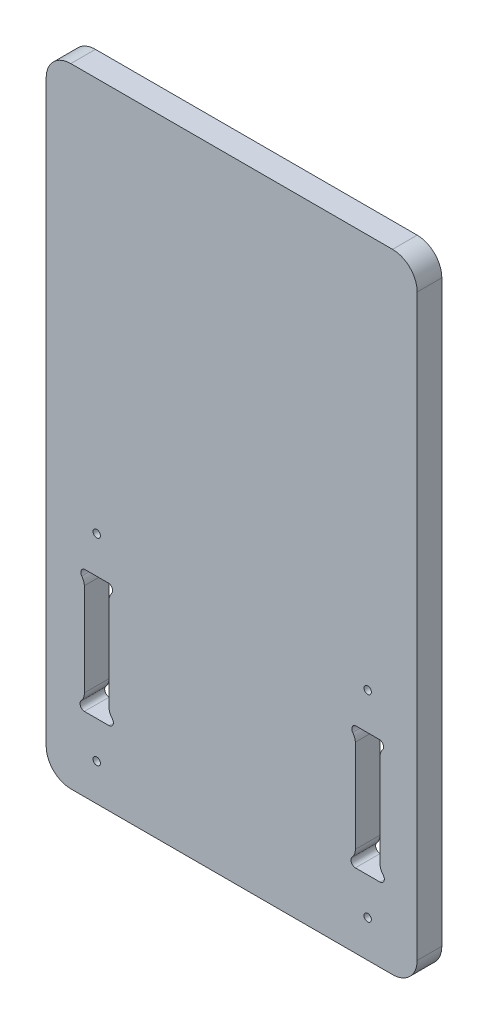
ISO-10303-21;
HEADER;
FILE_DESCRIPTION(('STEP AP214'),'2;1');
FILE_NAME('part.step','',(''),(''),'','','');
FILE_SCHEMA(('AUTOMOTIVE_DESIGN { 1 0 10303 214 1 1 1 1 }'));
ENDSEC;
DATA;
#1=APPLICATION_CONTEXT('core data for automotive mechanical design processes');
#2=APPLICATION_PROTOCOL_DEFINITION('international standard','automotive_design',2000,#1);
#3=PRODUCT_CONTEXT('',#1,'mechanical');
#4=PRODUCT('Part','Part','',(#3));
#5=PRODUCT_RELATED_PRODUCT_CATEGORY('part','',(#4));
#6=PRODUCT_DEFINITION_FORMATION('','',#4);
#7=PRODUCT_DEFINITION_CONTEXT('part definition',#1,'design');
#8=PRODUCT_DEFINITION('design','',#6,#7);
#9=PRODUCT_DEFINITION_SHAPE('','',#8);
#10=(LENGTH_UNIT() NAMED_UNIT(*) SI_UNIT(.MILLI.,.METRE.));
#11=(NAMED_UNIT(*) PLANE_ANGLE_UNIT() SI_UNIT($,.RADIAN.));
#12=(NAMED_UNIT(*) SI_UNIT($,.STERADIAN.) SOLID_ANGLE_UNIT());
#13=UNCERTAINTY_MEASURE_WITH_UNIT(LENGTH_MEASURE(1.E-05),#10,'distance_accuracy_value','');
#14=(GEOMETRIC_REPRESENTATION_CONTEXT(3) GLOBAL_UNCERTAINTY_ASSIGNED_CONTEXT((#13)) GLOBAL_UNIT_ASSIGNED_CONTEXT((#10,
#11,#12)) REPRESENTATION_CONTEXT('',''));
#15=CARTESIAN_POINT('',(0.,0.,0.));
#16=DIRECTION('',(0.,0.,1.));
#17=DIRECTION('',(1.,0.,0.));
#18=AXIS2_PLACEMENT_3D('',#15,#16,#17);
#19=CARTESIAN_POINT('',(-65.5100990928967,-45.,10.));
#20=DIRECTION('',(0.,0.,1.));
#21=DIRECTION('',(1.,0.,0.));
#22=AXIS2_PLACEMENT_3D('',#19,#20,#21);
#23=PLANE('',#22);
#24=CARTESIAN_POINT('',(55.,-40.,10.));
#25=DIRECTION('',(0.,0.,1.));
#26=DIRECTION('',(-1.,0.,0.));
#27=AXIS2_PLACEMENT_3D('',#24,#25,#26);
#28=CIRCLE('',#27,1.5);
#29=CARTESIAN_POINT('',(53.5,-40.,10.));
#30=VERTEX_POINT('',#29);
#31=EDGE_CURVE('E661',#30,#30,#28,.T.);
#32=ORIENTED_EDGE('',*,*,#31,.F.);
#33=EDGE_LOOP('',(#32));
#34=FACE_BOUND('',#33,.T.);
#35=CARTESIAN_POINT('',(50.1277697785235,-23.1165738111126,10.));
#36=DIRECTION('',(0.,0.,1.));
#37=DIRECTION('',(1.,0.,0.));
#38=AXIS2_PLACEMENT_3D('',#35,#36,#37);
#39=CIRCLE('',#38,1.88775510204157);
#40=CARTESIAN_POINT('',(48.6220765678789,-21.9779310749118,10.));
#41=VERTEX_POINT('',#40);
#42=CARTESIAN_POINT('',(50.0000000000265,-25.,10.));
#43=VERTEX_POINT('',#42);
#44=EDGE_CURVE('E263',#41,#43,#39,.T.);
#45=ORIENTED_EDGE('',*,*,#44,.F.);
#46=CARTESIAN_POINT('',(44.8979591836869,-18.4905581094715,10.));
#47=DIRECTION('',(0.,0.,-1.));
#48=DIRECTION('',(1.,0.,0.));
#49=AXIS2_PLACEMENT_3D('',#46,#47,#48);
#50=CIRCLE('',#49,5.10204081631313);
#51=CARTESIAN_POINT('',(50.,-18.4905581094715,10.));
#52=VERTEX_POINT('',#51);
#53=EDGE_CURVE('E255',#52,#41,#50,.T.);
#54=ORIENTED_EDGE('',*,*,#53,.F.);
#55=DIRECTION('',(0.,-1.,0.));
#56=VECTOR('',#55,1.);
#57=CARTESIAN_POINT('',(50.,-18.4905581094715,10.));
#58=LINE('',#57,#56);
#59=CARTESIAN_POINT('',(50.,19.1989379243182,10.));
#60=VERTEX_POINT('',#59);
#61=EDGE_CURVE('E298',#60,#52,#58,.T.);
#62=ORIENTED_EDGE('',*,*,#61,.F.);
#63=CARTESIAN_POINT('',(44.9063812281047,18.9059049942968,10.));
#64=DIRECTION('',(0.,0.,-1.));
#65=DIRECTION('',(1.,0.,0.));
#66=AXIS2_PLACEMENT_3D('',#63,#64,#65);
#67=CIRCLE('',#66,5.10204081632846);
#68=CARTESIAN_POINT('',(48.9512370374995,22.0155612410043,10.));
#69=VERTEX_POINT('',#68);
#70=EDGE_CURVE('E296',#69,#60,#67,.T.);
#71=ORIENTED_EDGE('',*,*,#70,.F.);
#72=CARTESIAN_POINT('',(50.4478336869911,23.166134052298,10.));
#73=DIRECTION('',(0.,0.,1.));
#74=DIRECTION('',(1.,0.,0.));
#75=AXIS2_PLACEMENT_3D('',#72,#73,#74);
#76=CIRCLE('',#75,1.88775510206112);
#77=CARTESIAN_POINT('',(49.9999999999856,25.,10.));
#78=VERTEX_POINT('',#77);
#79=EDGE_CURVE('E294',#78,#69,#76,.T.);
#80=ORIENTED_EDGE('',*,*,#79,.F.);
#81=DIRECTION('',(-1.,0.,0.));
#82=VECTOR('',#81,1.);
#83=CARTESIAN_POINT('',(60.0000000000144,25.,10.));
#84=LINE('',#83,#82);
#85=CARTESIAN_POINT('',(60.0000000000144,25.,10.));
#86=VERTEX_POINT('',#85);
#87=EDGE_CURVE('E292',#86,#78,#84,.T.);
#88=ORIENTED_EDGE('',*,*,#87,.F.);
#89=CARTESIAN_POINT('',(59.5521663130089,23.166134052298,10.));
#90=DIRECTION('',(0.,0.,1.));
#91=DIRECTION('',(-1.,0.,0.));
#92=AXIS2_PLACEMENT_3D('',#89,#90,#91);
#93=CIRCLE('',#92,1.88775510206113);
#94=CARTESIAN_POINT('',(61.0487629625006,22.0155612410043,10.));
#95=VERTEX_POINT('',#94);
#96=EDGE_CURVE('E290',#95,#86,#93,.T.);
#97=ORIENTED_EDGE('',*,*,#96,.F.);
#98=CARTESIAN_POINT('',(65.0936187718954,18.9059049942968,10.));
#99=DIRECTION('',(0.,0.,-1.));
#100=DIRECTION('',(-1.,0.,0.));
#101=AXIS2_PLACEMENT_3D('',#98,#99,#100);
#102=CIRCLE('',#101,5.10204081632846);
#103=CARTESIAN_POINT('',(60.,19.1989379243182,10.));
#104=VERTEX_POINT('',#103);
#105=EDGE_CURVE('E288',#104,#95,#102,.T.);
#106=ORIENTED_EDGE('',*,*,#105,.F.);
#107=DIRECTION('',(0.,1.,0.));
#108=VECTOR('',#107,1.);
#109=CARTESIAN_POINT('',(60.,-18.4905581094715,10.));
#110=LINE('',#109,#108);
#111=CARTESIAN_POINT('',(60.,-18.4905581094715,10.));
#112=VERTEX_POINT('',#111);
#113=EDGE_CURVE('E286',#112,#104,#110,.T.);
#114=ORIENTED_EDGE('',*,*,#113,.F.);
#115=CARTESIAN_POINT('',(65.1020408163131,-18.4905581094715,10.));
#116=DIRECTION('',(0.,0.,-1.));
#117=DIRECTION('',(-1.,0.,0.));
#118=AXIS2_PLACEMENT_3D('',#115,#116,#117);
#119=CIRCLE('',#118,5.10204081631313);
#120=CARTESIAN_POINT('',(61.3779234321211,-21.9779310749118,10.));
#121=VERTEX_POINT('',#120);
#122=EDGE_CURVE('E284',#121,#112,#119,.T.);
#123=ORIENTED_EDGE('',*,*,#122,.F.);
#124=CARTESIAN_POINT('',(59.8722302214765,-23.1165738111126,10.));
#125=DIRECTION('',(0.,0.,1.));
#126=DIRECTION('',(-1.,0.,0.));
#127=AXIS2_PLACEMENT_3D('',#124,#125,#126);
#128=CIRCLE('',#127,1.88775510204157);
#129=CARTESIAN_POINT('',(59.9999999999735,-25.,10.));
#130=VERTEX_POINT('',#129);
#131=EDGE_CURVE('E279',#130,#121,#128,.T.);
#132=ORIENTED_EDGE('',*,*,#131,.F.);
#133=DIRECTION('',(1.,0.,0.));
#134=VECTOR('',#133,1.);
#135=CARTESIAN_POINT('',(50.0000000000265,-25.,10.));
#136=LINE('',#135,#134);
#137=EDGE_CURVE('E277',#43,#130,#136,.T.);
#138=ORIENTED_EDGE('',*,*,#137,.F.);
#139=EDGE_LOOP('',(#45,#54,#62,#71,#80,#88,#97,#106,#114,#123,#132,#138));
#140=FACE_BOUND('',#139,.T.);
#141=DIRECTION('',(1.,0.,0.));
#142=VECTOR('',#141,1.);
#143=CARTESIAN_POINT('',(-50.0000000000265,-25.,10.));
#144=LINE('',#143,#142);
#145=CARTESIAN_POINT('',(-59.9999999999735,-25.,10.));
#146=VERTEX_POINT('',#145);
#147=CARTESIAN_POINT('',(-50.0000000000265,-25.,10.));
#148=VERTEX_POINT('',#147);
#149=EDGE_CURVE('E353',#146,#148,#144,.T.);
#150=ORIENTED_EDGE('',*,*,#149,.F.);
#151=CARTESIAN_POINT('',(-59.8722302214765,-23.1165738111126,10.));
#152=DIRECTION('',(0.,0.,1.));
#153=DIRECTION('',(1.,0.,0.));
#154=AXIS2_PLACEMENT_3D('',#151,#152,#153);
#155=CIRCLE('',#154,1.88775510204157);
#156=CARTESIAN_POINT('',(-61.3779234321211,-21.9779310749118,10.));
#157=VERTEX_POINT('',#156);
#158=EDGE_CURVE('E351',#157,#146,#155,.T.);
#159=ORIENTED_EDGE('',*,*,#158,.F.);
#160=CARTESIAN_POINT('',(-65.1020408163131,-18.4905581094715,10.));
#161=DIRECTION('',(0.,0.,-1.));
#162=DIRECTION('',(1.,0.,0.));
#163=AXIS2_PLACEMENT_3D('',#160,#161,#162);
#164=CIRCLE('',#163,5.10204081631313);
#165=CARTESIAN_POINT('',(-60.,-18.4905581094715,10.));
#166=VERTEX_POINT('',#165);
#167=EDGE_CURVE('E375',#166,#157,#164,.T.);
#168=ORIENTED_EDGE('',*,*,#167,.F.);
#169=DIRECTION('',(0.,-1.,0.));
#170=VECTOR('',#169,1.);
#171=CARTESIAN_POINT('',(-60.,-18.4905581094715,10.));
#172=LINE('',#171,#170);
#173=CARTESIAN_POINT('',(-60.,19.1989379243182,10.));
#174=VERTEX_POINT('',#173);
#175=EDGE_CURVE('E372',#174,#166,#172,.T.);
#176=ORIENTED_EDGE('',*,*,#175,.F.);
#177=CARTESIAN_POINT('',(-65.0936187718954,18.9059049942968,10.));
#178=DIRECTION('',(0.,0.,-1.));
#179=DIRECTION('',(1.,0.,0.));
#180=AXIS2_PLACEMENT_3D('',#177,#178,#179);
#181=CIRCLE('',#180,5.10204081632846);
#182=CARTESIAN_POINT('',(-61.0487629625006,22.0155612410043,10.));
#183=VERTEX_POINT('',#182);
#184=EDGE_CURVE('E370',#183,#174,#181,.T.);
#185=ORIENTED_EDGE('',*,*,#184,.F.);
#186=CARTESIAN_POINT('',(-59.5521663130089,23.166134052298,10.));
#187=DIRECTION('',(0.,0.,1.));
#188=DIRECTION('',(1.,0.,0.));
#189=AXIS2_PLACEMENT_3D('',#186,#187,#188);
#190=CIRCLE('',#189,1.88775510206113);
#191=CARTESIAN_POINT('',(-60.0000000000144,25.,10.));
#192=VERTEX_POINT('',#191);
#193=EDGE_CURVE('E368',#192,#183,#190,.T.);
#194=ORIENTED_EDGE('',*,*,#193,.F.);
#195=DIRECTION('',(-1.,0.,0.));
#196=VECTOR('',#195,1.);
#197=CARTESIAN_POINT('',(-60.0000000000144,25.,10.));
#198=LINE('',#197,#196);
#199=CARTESIAN_POINT('',(-49.9999999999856,25.,10.));
#200=VERTEX_POINT('',#199);
#201=EDGE_CURVE('E366',#200,#192,#198,.T.);
#202=ORIENTED_EDGE('',*,*,#201,.F.);
#203=CARTESIAN_POINT('',(-50.4478336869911,23.166134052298,10.));
#204=DIRECTION('',(0.,0.,1.));
#205=DIRECTION('',(-1.,0.,0.));
#206=AXIS2_PLACEMENT_3D('',#203,#204,#205);
#207=CIRCLE('',#206,1.88775510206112);
#208=CARTESIAN_POINT('',(-48.9512370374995,22.0155612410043,10.));
#209=VERTEX_POINT('',#208);
#210=EDGE_CURVE('E364',#209,#200,#207,.T.);
#211=ORIENTED_EDGE('',*,*,#210,.F.);
#212=CARTESIAN_POINT('',(-44.9063812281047,18.9059049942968,10.));
#213=DIRECTION('',(0.,0.,-1.));
#214=DIRECTION('',(-1.,0.,0.));
#215=AXIS2_PLACEMENT_3D('',#212,#213,#214);
#216=CIRCLE('',#215,5.10204081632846);
#217=CARTESIAN_POINT('',(-50.,19.1989379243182,10.));
#218=VERTEX_POINT('',#217);
#219=EDGE_CURVE('E362',#218,#209,#216,.T.);
#220=ORIENTED_EDGE('',*,*,#219,.F.);
#221=DIRECTION('',(0.,1.,0.));
#222=VECTOR('',#221,1.);
#223=CARTESIAN_POINT('',(-50.,-18.4905581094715,10.));
#224=LINE('',#223,#222);
#225=CARTESIAN_POINT('',(-50.,-18.4905581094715,10.));
#226=VERTEX_POINT('',#225);
#227=EDGE_CURVE('E360',#226,#218,#224,.T.);
#228=ORIENTED_EDGE('',*,*,#227,.F.);
#229=CARTESIAN_POINT('',(-44.8979591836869,-18.4905581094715,10.));
#230=DIRECTION('',(0.,0.,-1.));
#231=DIRECTION('',(-1.,0.,0.));
#232=AXIS2_PLACEMENT_3D('',#229,#230,#231);
#233=CIRCLE('',#232,5.10204081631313);
#234=CARTESIAN_POINT('',(-48.6220765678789,-21.9779310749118,10.));
#235=VERTEX_POINT('',#234);
#236=EDGE_CURVE('E358',#235,#226,#233,.T.);
#237=ORIENTED_EDGE('',*,*,#236,.F.);
#238=CARTESIAN_POINT('',(-50.1277697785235,-23.1165738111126,10.));
#239=DIRECTION('',(0.,0.,1.));
#240=DIRECTION('',(-1.,0.,0.));
#241=AXIS2_PLACEMENT_3D('',#238,#239,#240);
#242=CIRCLE('',#241,1.88775510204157);
#243=EDGE_CURVE('E356',#148,#235,#242,.T.);
#244=ORIENTED_EDGE('',*,*,#243,.F.);
#245=EDGE_LOOP('',(#150,#159,#168,#176,#185,#194,#202,#211,#220,#228,#237,#244));
#246=FACE_BOUND('',#245,.T.);
#247=CARTESIAN_POINT('',(-55.,40.,10.));
#248=DIRECTION('',(0.,0.,1.));
#249=DIRECTION('',(-1.,0.,0.));
#250=AXIS2_PLACEMENT_3D('',#247,#248,#249);
#251=CIRCLE('',#250,1.5);
#252=CARTESIAN_POINT('',(-56.5,40.,10.));
#253=VERTEX_POINT('',#252);
#254=EDGE_CURVE('E437',#253,#253,#251,.T.);
#255=ORIENTED_EDGE('',*,*,#254,.F.);
#256=EDGE_LOOP('',(#255));
#257=FACE_BOUND('',#256,.T.);
#258=CARTESIAN_POINT('',(-65.5100990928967,-45.,10.));
#259=DIRECTION('',(0.,0.,1.));
#260=DIRECTION('',(1.,0.,0.));
#261=AXIS2_PLACEMENT_3D('',#258,#259,#260);
#262=CIRCLE('',#261,10.);
#263=CARTESIAN_POINT('',(-75.5100990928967,-45.,10.));
#264=VERTEX_POINT('',#263);
#265=CARTESIAN_POINT('',(-65.5100990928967,-55.,10.));
#266=VERTEX_POINT('',#265);
#267=EDGE_CURVE('E441',#264,#266,#262,.T.);
#268=ORIENTED_EDGE('',*,*,#267,.T.);
#269=DIRECTION('',(1.,0.,0.));
#270=VECTOR('',#269,1.);
#271=CARTESIAN_POINT('',(-65.5100990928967,-55.,10.));
#272=LINE('',#271,#270);
#273=CARTESIAN_POINT('',(65.1021458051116,-55.,10.));
#274=VERTEX_POINT('',#273);
#275=EDGE_CURVE('E444',#266,#274,#272,.T.);
#276=ORIENTED_EDGE('',*,*,#275,.T.);
#277=CARTESIAN_POINT('',(65.1021458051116,-45.,10.));
#278=DIRECTION('',(0.,0.,1.));
#279=DIRECTION('',(1.,0.,0.));
#280=AXIS2_PLACEMENT_3D('',#277,#278,#279);
#281=CIRCLE('',#280,10.);
#282=CARTESIAN_POINT('',(75.1021458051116,-45.,10.));
#283=VERTEX_POINT('',#282);
#284=EDGE_CURVE('E447',#274,#283,#281,.T.);
#285=ORIENTED_EDGE('',*,*,#284,.T.);
#286=DIRECTION('',(0.,1.,0.));
#287=VECTOR('',#286,1.);
#288=CARTESIAN_POINT('',(75.1021458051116,-45.0000000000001,10.));
#289=LINE('',#288,#287);
#290=CARTESIAN_POINT('',(75.1021458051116,190.,10.));
#291=VERTEX_POINT('',#290);
#292=EDGE_CURVE('E449',#283,#291,#289,.T.);
#293=ORIENTED_EDGE('',*,*,#292,.T.);
#294=CARTESIAN_POINT('',(65.1021458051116,190.,10.));
#295=DIRECTION('',(0.,0.,1.));
#296=DIRECTION('',(1.,0.,0.));
#297=AXIS2_PLACEMENT_3D('',#294,#295,#296);
#298=CIRCLE('',#297,10.);
#299=CARTESIAN_POINT('',(65.1021458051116,200.,10.));
#300=VERTEX_POINT('',#299);
#301=EDGE_CURVE('E451',#291,#300,#298,.T.);
#302=ORIENTED_EDGE('',*,*,#301,.T.);
#303=DIRECTION('',(-1.,0.,0.));
#304=VECTOR('',#303,1.);
#305=CARTESIAN_POINT('',(-65.5100990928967,200.,10.));
#306=LINE('',#305,#304);
#307=CARTESIAN_POINT('',(-65.5100990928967,200.,10.));
#308=VERTEX_POINT('',#307);
#309=EDGE_CURVE('E453',#300,#308,#306,.T.);
#310=ORIENTED_EDGE('',*,*,#309,.T.);
#311=CARTESIAN_POINT('',(-65.5100990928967,190.,10.));
#312=DIRECTION('',(0.,0.,1.));
#313=DIRECTION('',(-1.,0.,0.));
#314=AXIS2_PLACEMENT_3D('',#311,#312,#313);
#315=CIRCLE('',#314,10.);
#316=CARTESIAN_POINT('',(-75.5100990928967,190.,10.));
#317=VERTEX_POINT('',#316);
#318=EDGE_CURVE('E455',#308,#317,#315,.T.);
#319=ORIENTED_EDGE('',*,*,#318,.T.);
#320=DIRECTION('',(0.,-1.,0.));
#321=VECTOR('',#320,1.);
#322=CARTESIAN_POINT('',(-75.5100990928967,190.,10.));
#323=LINE('',#322,#321);
#324=EDGE_CURVE('E457',#317,#264,#323,.T.);
#325=ORIENTED_EDGE('',*,*,#324,.T.);
#326=EDGE_LOOP('',(#268,#276,#285,#293,#302,#310,#319,#325));
#327=FACE_BOUND('',#326,.T.);
#328=CARTESIAN_POINT('',(-55.,-40.,10.));
#329=DIRECTION('',(0.,0.,1.));
#330=DIRECTION('',(1.,0.,0.));
#331=AXIS2_PLACEMENT_3D('',#328,#329,#330);
#332=CIRCLE('',#331,1.5);
#333=CARTESIAN_POINT('',(-53.5,-40.,10.));
#334=VERTEX_POINT('',#333);
#335=EDGE_CURVE('E301',#334,#334,#332,.T.);
#336=ORIENTED_EDGE('',*,*,#335,.F.);
#337=EDGE_LOOP('',(#336));
#338=FACE_BOUND('',#337,.T.);
#339=CARTESIAN_POINT('',(55.,40.,10.));
#340=DIRECTION('',(0.,0.,1.));
#341=DIRECTION('',(1.,0.,0.));
#342=AXIS2_PLACEMENT_3D('',#339,#340,#341);
#343=CIRCLE('',#342,1.5);
#344=CARTESIAN_POINT('',(56.5,40.,10.));
#345=VERTEX_POINT('',#344);
#346=EDGE_CURVE('E662',#345,#345,#343,.T.);
#347=ORIENTED_EDGE('',*,*,#346,.F.);
#348=EDGE_LOOP('',(#347));
#349=FACE_BOUND('',#348,.T.);
#350=ADVANCED_FACE('F45',(#34,#140,#246,#257,#327,#338,#349),#23,.T.);
#351=CARTESIAN_POINT('',(-65.5100990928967,-45.,0.));
#352=DIRECTION('',(0.,0.,1.));
#353=DIRECTION('',(1.,0.,0.));
#354=AXIS2_PLACEMENT_3D('',#351,#352,#353);
#355=PLANE('',#354);
#356=CARTESIAN_POINT('',(-55.,-40.,0.));
#357=DIRECTION('',(0.,0.,1.));
#358=DIRECTION('',(1.,0.,0.));
#359=AXIS2_PLACEMENT_3D('',#356,#357,#358);
#360=CIRCLE('',#359,3.70000000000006);
#361=CARTESIAN_POINT('',(-51.2999999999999,-40.,0.));
#362=VERTEX_POINT('',#361);
#363=EDGE_CURVE('E507',#362,#362,#360,.T.);
#364=ORIENTED_EDGE('',*,*,#363,.T.);
#365=EDGE_LOOP('',(#364));
#366=FACE_BOUND('',#365,.T.);
#367=CARTESIAN_POINT('',(55.,-40.,0.));
#368=DIRECTION('',(0.,0.,1.));
#369=DIRECTION('',(1.,0.,0.));
#370=AXIS2_PLACEMENT_3D('',#367,#368,#369);
#371=CIRCLE('',#370,3.70000000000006);
#372=CARTESIAN_POINT('',(58.7000000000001,-40.,0.));
#373=VERTEX_POINT('',#372);
#374=EDGE_CURVE('E504',#373,#373,#371,.T.);
#375=ORIENTED_EDGE('',*,*,#374,.T.);
#376=EDGE_LOOP('',(#375));
#377=FACE_BOUND('',#376,.T.);
#378=CARTESIAN_POINT('',(-55.,40.,0.));
#379=DIRECTION('',(0.,0.,1.));
#380=DIRECTION('',(1.,0.,0.));
#381=AXIS2_PLACEMENT_3D('',#378,#379,#380);
#382=CIRCLE('',#381,3.69999999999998);
#383=CARTESIAN_POINT('',(-51.3,40.,0.));
#384=VERTEX_POINT('',#383);
#385=EDGE_CURVE('E501',#384,#384,#382,.T.);
#386=ORIENTED_EDGE('',*,*,#385,.T.);
#387=EDGE_LOOP('',(#386));
#388=FACE_BOUND('',#387,.T.);
#389=CARTESIAN_POINT('',(55.,40.,0.));
#390=DIRECTION('',(0.,0.,1.));
#391=DIRECTION('',(1.,0.,0.));
#392=AXIS2_PLACEMENT_3D('',#389,#390,#391);
#393=CIRCLE('',#392,3.69999999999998);
#394=CARTESIAN_POINT('',(58.7,40.,0.));
#395=VERTEX_POINT('',#394);
#396=EDGE_CURVE('E498',#395,#395,#393,.T.);
#397=ORIENTED_EDGE('',*,*,#396,.T.);
#398=EDGE_LOOP('',(#397));
#399=FACE_BOUND('',#398,.T.);
#400=CARTESIAN_POINT('',(-59.8722302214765,-23.1165738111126,0.));
#401=DIRECTION('',(0.,0.,1.));
#402=DIRECTION('',(1.,0.,0.));
#403=AXIS2_PLACEMENT_3D('',#400,#401,#402);
#404=CIRCLE('',#403,1.88775510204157);
#405=CARTESIAN_POINT('',(-61.3779234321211,-21.9779310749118,0.));
#406=VERTEX_POINT('',#405);
#407=CARTESIAN_POINT('',(-59.9999999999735,-25.,0.));
#408=VERTEX_POINT('',#407);
#409=EDGE_CURVE('E271',#406,#408,#404,.T.);
#410=ORIENTED_EDGE('',*,*,#409,.T.);
#411=DIRECTION('',(1.,0.,0.));
#412=VECTOR('',#411,1.);
#413=CARTESIAN_POINT('',(-50.0000000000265,-25.,0.));
#414=LINE('',#413,#412);
#415=CARTESIAN_POINT('',(-50.0000000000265,-25.,0.));
#416=VERTEX_POINT('',#415);
#417=EDGE_CURVE('E380',#408,#416,#414,.T.);
#418=ORIENTED_EDGE('',*,*,#417,.T.);
#419=CARTESIAN_POINT('',(-50.1277697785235,-23.1165738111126,0.));
#420=DIRECTION('',(0.,0.,1.));
#421=DIRECTION('',(-1.,0.,0.));
#422=AXIS2_PLACEMENT_3D('',#419,#420,#421);
#423=CIRCLE('',#422,1.88775510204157);
#424=CARTESIAN_POINT('',(-48.6220765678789,-21.9779310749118,0.));
#425=VERTEX_POINT('',#424);
#426=EDGE_CURVE('E383',#416,#425,#423,.T.);
#427=ORIENTED_EDGE('',*,*,#426,.T.);
#428=CARTESIAN_POINT('',(-44.8979591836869,-18.4905581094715,0.));
#429=DIRECTION('',(0.,0.,-1.));
#430=DIRECTION('',(-1.,0.,0.));
#431=AXIS2_PLACEMENT_3D('',#428,#429,#430);
#432=CIRCLE('',#431,5.10204081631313);
#433=CARTESIAN_POINT('',(-50.,-18.4905581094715,0.));
#434=VERTEX_POINT('',#433);
#435=EDGE_CURVE('E386',#425,#434,#432,.T.);
#436=ORIENTED_EDGE('',*,*,#435,.T.);
#437=DIRECTION('',(0.,1.,0.));
#438=VECTOR('',#437,1.);
#439=CARTESIAN_POINT('',(-50.,-18.4905581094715,0.));
#440=LINE('',#439,#438);
#441=CARTESIAN_POINT('',(-50.,19.1989379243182,0.));
#442=VERTEX_POINT('',#441);
#443=EDGE_CURVE('E389',#434,#442,#440,.T.);
#444=ORIENTED_EDGE('',*,*,#443,.T.);
#445=CARTESIAN_POINT('',(-44.9063812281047,18.9059049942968,0.));
#446=DIRECTION('',(0.,0.,-1.));
#447=DIRECTION('',(-1.,0.,0.));
#448=AXIS2_PLACEMENT_3D('',#445,#446,#447);
#449=CIRCLE('',#448,5.10204081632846);
#450=CARTESIAN_POINT('',(-48.9512370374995,22.0155612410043,0.));
#451=VERTEX_POINT('',#450);
#452=EDGE_CURVE('E392',#442,#451,#449,.T.);
#453=ORIENTED_EDGE('',*,*,#452,.T.);
#454=CARTESIAN_POINT('',(-50.4478336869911,23.166134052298,0.));
#455=DIRECTION('',(0.,0.,1.));
#456=DIRECTION('',(-1.,0.,0.));
#457=AXIS2_PLACEMENT_3D('',#454,#455,#456);
#458=CIRCLE('',#457,1.88775510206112);
#459=CARTESIAN_POINT('',(-49.9999999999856,25.,0.));
#460=VERTEX_POINT('',#459);
#461=EDGE_CURVE('E395',#451,#460,#458,.T.);
#462=ORIENTED_EDGE('',*,*,#461,.T.);
#463=DIRECTION('',(-1.,0.,0.));
#464=VECTOR('',#463,1.);
#465=CARTESIAN_POINT('',(-60.0000000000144,25.,0.));
#466=LINE('',#465,#464);
#467=CARTESIAN_POINT('',(-60.0000000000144,25.,0.));
#468=VERTEX_POINT('',#467);
#469=EDGE_CURVE('E398',#460,#468,#466,.T.);
#470=ORIENTED_EDGE('',*,*,#469,.T.);
#471=CARTESIAN_POINT('',(-59.5521663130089,23.166134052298,0.));
#472=DIRECTION('',(0.,0.,1.));
#473=DIRECTION('',(1.,0.,0.));
#474=AXIS2_PLACEMENT_3D('',#471,#472,#473);
#475=CIRCLE('',#474,1.88775510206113);
#476=CARTESIAN_POINT('',(-61.0487629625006,22.0155612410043,0.));
#477=VERTEX_POINT('',#476);
#478=EDGE_CURVE('E401',#468,#477,#475,.T.);
#479=ORIENTED_EDGE('',*,*,#478,.T.);
#480=CARTESIAN_POINT('',(-65.0936187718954,18.9059049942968,0.));
#481=DIRECTION('',(0.,0.,-1.));
#482=DIRECTION('',(1.,0.,0.));
#483=AXIS2_PLACEMENT_3D('',#480,#481,#482);
#484=CIRCLE('',#483,5.10204081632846);
#485=CARTESIAN_POINT('',(-60.,19.1989379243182,0.));
#486=VERTEX_POINT('',#485);
#487=EDGE_CURVE('E404',#477,#486,#484,.T.);
#488=ORIENTED_EDGE('',*,*,#487,.T.);
#489=DIRECTION('',(0.,-1.,0.));
#490=VECTOR('',#489,1.);
#491=CARTESIAN_POINT('',(-60.,-18.4905581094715,0.));
#492=LINE('',#491,#490);
#493=CARTESIAN_POINT('',(-60.,-18.4905581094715,0.));
#494=VERTEX_POINT('',#493);
#495=EDGE_CURVE('E407',#486,#494,#492,.T.);
#496=ORIENTED_EDGE('',*,*,#495,.T.);
#497=CARTESIAN_POINT('',(-65.1020408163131,-18.4905581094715,0.));
#498=DIRECTION('',(0.,0.,-1.));
#499=DIRECTION('',(1.,0.,0.));
#500=AXIS2_PLACEMENT_3D('',#497,#498,#499);
#501=CIRCLE('',#500,5.10204081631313);
#502=EDGE_CURVE('E354',#494,#406,#501,.T.);
#503=ORIENTED_EDGE('',*,*,#502,.T.);
#504=EDGE_LOOP('',(#410,#418,#427,#436,#444,#453,#462,#470,#479,#488,#496,#503));
#505=FACE_BOUND('',#504,.T.);
#506=CARTESIAN_POINT('',(-65.5100990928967,-45.,0.));
#507=DIRECTION('',(0.,0.,1.));
#508=DIRECTION('',(1.,0.,0.));
#509=AXIS2_PLACEMENT_3D('',#506,#507,#508);
#510=CIRCLE('',#509,10.);
#511=CARTESIAN_POINT('',(-75.5100990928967,-45.,0.));
#512=VERTEX_POINT('',#511);
#513=CARTESIAN_POINT('',(-65.5100990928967,-55.,0.));
#514=VERTEX_POINT('',#513);
#515=EDGE_CURVE('E440',#512,#514,#510,.T.);
#516=ORIENTED_EDGE('',*,*,#515,.F.);
#517=DIRECTION('',(0.,-1.,0.));
#518=VECTOR('',#517,1.);
#519=CARTESIAN_POINT('',(-75.5100990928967,190.,0.));
#520=LINE('',#519,#518);
#521=CARTESIAN_POINT('',(-75.5100990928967,190.,0.));
#522=VERTEX_POINT('',#521);
#523=EDGE_CURVE('E445',#522,#512,#520,.T.);
#524=ORIENTED_EDGE('',*,*,#523,.F.);
#525=CARTESIAN_POINT('',(-65.5100990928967,190.,0.));
#526=DIRECTION('',(0.,0.,1.));
#527=DIRECTION('',(-1.,0.,0.));
#528=AXIS2_PLACEMENT_3D('',#525,#526,#527);
#529=CIRCLE('',#528,10.);
#530=CARTESIAN_POINT('',(-65.5100990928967,200.,0.));
#531=VERTEX_POINT('',#530);
#532=EDGE_CURVE('E472',#531,#522,#529,.T.);
#533=ORIENTED_EDGE('',*,*,#532,.F.);
#534=DIRECTION('',(-1.,0.,0.));
#535=VECTOR('',#534,1.);
#536=CARTESIAN_POINT('',(-65.5100990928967,200.,0.));
#537=LINE('',#536,#535);
#538=CARTESIAN_POINT('',(65.1021458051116,200.,0.));
#539=VERTEX_POINT('',#538);
#540=EDGE_CURVE('E470',#539,#531,#537,.T.);
#541=ORIENTED_EDGE('',*,*,#540,.F.);
#542=CARTESIAN_POINT('',(65.1021458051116,190.,0.));
#543=DIRECTION('',(0.,0.,1.));
#544=DIRECTION('',(1.,0.,0.));
#545=AXIS2_PLACEMENT_3D('',#542,#543,#544);
#546=CIRCLE('',#545,10.);
#547=CARTESIAN_POINT('',(75.1021458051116,190.,0.));
#548=VERTEX_POINT('',#547);
#549=EDGE_CURVE('E468',#548,#539,#546,.T.);
#550=ORIENTED_EDGE('',*,*,#549,.F.);
#551=DIRECTION('',(0.,1.,0.));
#552=VECTOR('',#551,1.);
#553=CARTESIAN_POINT('',(75.1021458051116,-45.0000000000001,0.));
#554=LINE('',#553,#552);
#555=CARTESIAN_POINT('',(75.1021458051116,-45.,0.));
#556=VERTEX_POINT('',#555);
#557=EDGE_CURVE('E466',#556,#548,#554,.T.);
#558=ORIENTED_EDGE('',*,*,#557,.F.);
#559=CARTESIAN_POINT('',(65.1021458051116,-45.,0.));
#560=DIRECTION('',(0.,0.,1.));
#561=DIRECTION('',(1.,0.,0.));
#562=AXIS2_PLACEMENT_3D('',#559,#560,#561);
#563=CIRCLE('',#562,10.);
#564=CARTESIAN_POINT('',(65.1021458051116,-55.,0.));
#565=VERTEX_POINT('',#564);
#566=EDGE_CURVE('E464',#565,#556,#563,.T.);
#567=ORIENTED_EDGE('',*,*,#566,.F.);
#568=DIRECTION('',(1.,0.,0.));
#569=VECTOR('',#568,1.);
#570=CARTESIAN_POINT('',(-65.5100990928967,-55.,0.));
#571=LINE('',#570,#569);
#572=EDGE_CURVE('E462',#514,#565,#571,.T.);
#573=ORIENTED_EDGE('',*,*,#572,.F.);
#574=EDGE_LOOP('',(#516,#524,#533,#541,#550,#558,#567,#573));
#575=FACE_BOUND('',#574,.T.);
#576=CARTESIAN_POINT('',(44.8979591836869,-18.4905581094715,0.));
#577=DIRECTION('',(0.,0.,-1.));
#578=DIRECTION('',(1.,0.,0.));
#579=AXIS2_PLACEMENT_3D('',#576,#577,#578);
#580=CIRCLE('',#579,5.10204081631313);
#581=CARTESIAN_POINT('',(50.,-18.4905581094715,0.));
#582=VERTEX_POINT('',#581);
#583=CARTESIAN_POINT('',(48.6220765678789,-21.9779310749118,0.));
#584=VERTEX_POINT('',#583);
#585=EDGE_CURVE('E69',#582,#584,#580,.T.);
#586=ORIENTED_EDGE('',*,*,#585,.T.);
#587=CARTESIAN_POINT('',(50.1277697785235,-23.1165738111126,0.));
#588=DIRECTION('',(0.,0.,1.));
#589=DIRECTION('',(1.,0.,0.));
#590=AXIS2_PLACEMENT_3D('',#587,#588,#589);
#591=CIRCLE('',#590,1.88775510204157);
#592=CARTESIAN_POINT('',(50.0000000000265,-25.,0.));
#593=VERTEX_POINT('',#592);
#594=EDGE_CURVE('E270',#584,#593,#591,.T.);
#595=ORIENTED_EDGE('',*,*,#594,.T.);
#596=DIRECTION('',(1.,0.,0.));
#597=VECTOR('',#596,1.);
#598=CARTESIAN_POINT('',(50.0000000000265,-25.,0.));
#599=LINE('',#598,#597);
#600=CARTESIAN_POINT('',(59.9999999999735,-25.,0.));
#601=VERTEX_POINT('',#600);
#602=EDGE_CURVE('E303',#593,#601,#599,.T.);
#603=ORIENTED_EDGE('',*,*,#602,.T.);
#604=CARTESIAN_POINT('',(59.8722302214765,-23.1165738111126,0.));
#605=DIRECTION('',(0.,0.,1.));
#606=DIRECTION('',(-1.,0.,0.));
#607=AXIS2_PLACEMENT_3D('',#604,#605,#606);
#608=CIRCLE('',#607,1.88775510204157);
#609=CARTESIAN_POINT('',(61.3779234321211,-21.9779310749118,0.));
#610=VERTEX_POINT('',#609);
#611=EDGE_CURVE('E306',#601,#610,#608,.T.);
#612=ORIENTED_EDGE('',*,*,#611,.T.);
#613=CARTESIAN_POINT('',(65.1020408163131,-18.4905581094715,0.));
#614=DIRECTION('',(0.,0.,-1.));
#615=DIRECTION('',(-1.,0.,0.));
#616=AXIS2_PLACEMENT_3D('',#613,#614,#615);
#617=CIRCLE('',#616,5.10204081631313);
#618=CARTESIAN_POINT('',(60.,-18.4905581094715,0.));
#619=VERTEX_POINT('',#618);
#620=EDGE_CURVE('E309',#610,#619,#617,.T.);
#621=ORIENTED_EDGE('',*,*,#620,.T.);
#622=DIRECTION('',(0.,1.,0.));
#623=VECTOR('',#622,1.);
#624=CARTESIAN_POINT('',(60.,-18.4905581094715,0.));
#625=LINE('',#624,#623);
#626=CARTESIAN_POINT('',(60.,19.1989379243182,0.));
#627=VERTEX_POINT('',#626);
#628=EDGE_CURVE('E312',#619,#627,#625,.T.);
#629=ORIENTED_EDGE('',*,*,#628,.T.);
#630=CARTESIAN_POINT('',(65.0936187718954,18.9059049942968,0.));
#631=DIRECTION('',(0.,0.,-1.));
#632=DIRECTION('',(-1.,0.,0.));
#633=AXIS2_PLACEMENT_3D('',#630,#631,#632);
#634=CIRCLE('',#633,5.10204081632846);
#635=CARTESIAN_POINT('',(61.0487629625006,22.0155612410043,0.));
#636=VERTEX_POINT('',#635);
#637=EDGE_CURVE('E315',#627,#636,#634,.T.);
#638=ORIENTED_EDGE('',*,*,#637,.T.);
#639=CARTESIAN_POINT('',(59.5521663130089,23.166134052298,0.));
#640=DIRECTION('',(0.,0.,1.));
#641=DIRECTION('',(-1.,0.,0.));
#642=AXIS2_PLACEMENT_3D('',#639,#640,#641);
#643=CIRCLE('',#642,1.88775510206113);
#644=CARTESIAN_POINT('',(60.0000000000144,25.,0.));
#645=VERTEX_POINT('',#644);
#646=EDGE_CURVE('E318',#636,#645,#643,.T.);
#647=ORIENTED_EDGE('',*,*,#646,.T.);
#648=DIRECTION('',(-1.,0.,0.));
#649=VECTOR('',#648,1.);
#650=CARTESIAN_POINT('',(60.0000000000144,25.,0.));
#651=LINE('',#650,#649);
#652=CARTESIAN_POINT('',(49.9999999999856,25.,0.));
#653=VERTEX_POINT('',#652);
#654=EDGE_CURVE('E321',#645,#653,#651,.T.);
#655=ORIENTED_EDGE('',*,*,#654,.T.);
#656=CARTESIAN_POINT('',(50.4478336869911,23.166134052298,0.));
#657=DIRECTION('',(0.,0.,1.));
#658=DIRECTION('',(1.,0.,0.));
#659=AXIS2_PLACEMENT_3D('',#656,#657,#658);
#660=CIRCLE('',#659,1.88775510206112);
#661=CARTESIAN_POINT('',(48.9512370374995,22.0155612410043,0.));
#662=VERTEX_POINT('',#661);
#663=EDGE_CURVE('E324',#653,#662,#660,.T.);
#664=ORIENTED_EDGE('',*,*,#663,.T.);
#665=CARTESIAN_POINT('',(44.9063812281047,18.9059049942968,0.));
#666=DIRECTION('',(0.,0.,-1.));
#667=DIRECTION('',(1.,0.,0.));
#668=AXIS2_PLACEMENT_3D('',#665,#666,#667);
#669=CIRCLE('',#668,5.10204081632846);
#670=CARTESIAN_POINT('',(50.,19.1989379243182,0.));
#671=VERTEX_POINT('',#670);
#672=EDGE_CURVE('E327',#662,#671,#669,.T.);
#673=ORIENTED_EDGE('',*,*,#672,.T.);
#674=DIRECTION('',(0.,-1.,0.));
#675=VECTOR('',#674,1.);
#676=CARTESIAN_POINT('',(50.,-18.4905581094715,0.));
#677=LINE('',#676,#675);
#678=EDGE_CURVE('E264',#671,#582,#677,.T.);
#679=ORIENTED_EDGE('',*,*,#678,.T.);
#680=EDGE_LOOP('',(#586,#595,#603,#612,#621,#629,#638,#647,#655,#664,#673,#679));
#681=FACE_BOUND('',#680,.T.);
#682=ADVANCED_FACE('F527',(#366,#377,#388,#399,#505,#575,#681),#355,.F.);
#683=CARTESIAN_POINT('',(-65.5100990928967,-45.,10.));
#684=DIRECTION('',(0.,0.,-1.));
#685=DIRECTION('',(-1.,0.,0.));
#686=AXIS2_PLACEMENT_3D('',#683,#684,#685);
#687=CYLINDRICAL_SURFACE('',#686,10.);
#688=ORIENTED_EDGE('',*,*,#515,.T.);
#689=DIRECTION('',(0.,0.,-1.));
#690=VECTOR('',#689,1.);
#691=CARTESIAN_POINT('',(-65.5100990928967,-55.,10.));
#692=LINE('',#691,#690);
#693=EDGE_CURVE('E495',#266,#514,#692,.T.);
#694=ORIENTED_EDGE('',*,*,#693,.F.);
#695=ORIENTED_EDGE('',*,*,#267,.F.);
#696=DIRECTION('',(0.,0.,-1.));
#697=VECTOR('',#696,1.);
#698=CARTESIAN_POINT('',(-75.5100990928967,-45.,10.));
#699=LINE('',#698,#697);
#700=EDGE_CURVE('E459',#264,#512,#699,.T.);
#701=ORIENTED_EDGE('',*,*,#700,.T.);
#702=EDGE_LOOP('',(#688,#694,#695,#701));
#703=FACE_BOUND('',#702,.T.);
#704=ADVANCED_FACE('F530',(#703),#687,.T.);
#705=CARTESIAN_POINT('',(-65.5100990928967,-55.,10.));
#706=DIRECTION('',(0.,1.,0.));
#707=DIRECTION('',(0.,0.,1.));
#708=AXIS2_PLACEMENT_3D('',#705,#706,#707);
#709=PLANE('',#708);
#710=ORIENTED_EDGE('',*,*,#572,.T.);
#711=DIRECTION('',(0.,0.,-1.));
#712=VECTOR('',#711,1.);
#713=CARTESIAN_POINT('',(65.1021458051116,-55.,10.));
#714=LINE('',#713,#712);
#715=EDGE_CURVE('E492',#274,#565,#714,.T.);
#716=ORIENTED_EDGE('',*,*,#715,.F.);
#717=ORIENTED_EDGE('',*,*,#275,.F.);
#718=ORIENTED_EDGE('',*,*,#693,.T.);
#719=EDGE_LOOP('',(#710,#716,#717,#718));
#720=FACE_BOUND('',#719,.T.);
#721=ADVANCED_FACE('F623',(#720),#709,.F.);
#722=CARTESIAN_POINT('',(65.1021458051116,-45.,10.));
#723=DIRECTION('',(0.,0.,-1.));
#724=DIRECTION('',(-1.,0.,0.));
#725=AXIS2_PLACEMENT_3D('',#722,#723,#724);
#726=CYLINDRICAL_SURFACE('',#725,10.);
#727=ORIENTED_EDGE('',*,*,#566,.T.);
#728=DIRECTION('',(0.,0.,-1.));
#729=VECTOR('',#728,1.);
#730=CARTESIAN_POINT('',(75.1021458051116,-45.,10.));
#731=LINE('',#730,#729);
#732=EDGE_CURVE('E489',#283,#556,#731,.T.);
#733=ORIENTED_EDGE('',*,*,#732,.F.);
#734=ORIENTED_EDGE('',*,*,#284,.F.);
#735=ORIENTED_EDGE('',*,*,#715,.T.);
#736=EDGE_LOOP('',(#727,#733,#734,#735));
#737=FACE_BOUND('',#736,.T.);
#738=ADVANCED_FACE('F619',(#737),#726,.T.);
#739=CARTESIAN_POINT('',(75.1021458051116,-45.0000000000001,10.));
#740=DIRECTION('',(-1.,0.,0.));
#741=DIRECTION('',(0.,0.,1.));
#742=AXIS2_PLACEMENT_3D('',#739,#740,#741);
#743=PLANE('',#742);
#744=ORIENTED_EDGE('',*,*,#557,.T.);
#745=DIRECTION('',(0.,0.,-1.));
#746=VECTOR('',#745,1.);
#747=CARTESIAN_POINT('',(75.1021458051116,190.,10.));
#748=LINE('',#747,#746);
#749=EDGE_CURVE('E486',#291,#548,#748,.T.);
#750=ORIENTED_EDGE('',*,*,#749,.F.);
#751=ORIENTED_EDGE('',*,*,#292,.F.);
#752=ORIENTED_EDGE('',*,*,#732,.T.);
#753=EDGE_LOOP('',(#744,#750,#751,#752));
#754=FACE_BOUND('',#753,.T.);
#755=ADVANCED_FACE('F615',(#754),#743,.F.);
#756=CARTESIAN_POINT('',(65.1021458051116,190.,10.));
#757=DIRECTION('',(0.,0.,-1.));
#758=DIRECTION('',(-1.,0.,0.));
#759=AXIS2_PLACEMENT_3D('',#756,#757,#758);
#760=CYLINDRICAL_SURFACE('',#759,10.);
#761=ORIENTED_EDGE('',*,*,#549,.T.);
#762=DIRECTION('',(0.,0.,-1.));
#763=VECTOR('',#762,1.);
#764=CARTESIAN_POINT('',(65.1021458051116,200.,10.));
#765=LINE('',#764,#763);
#766=EDGE_CURVE('E483',#300,#539,#765,.T.);
#767=ORIENTED_EDGE('',*,*,#766,.F.);
#768=ORIENTED_EDGE('',*,*,#301,.F.);
#769=ORIENTED_EDGE('',*,*,#749,.T.);
#770=EDGE_LOOP('',(#761,#767,#768,#769));
#771=FACE_BOUND('',#770,.T.);
#772=ADVANCED_FACE('F611',(#771),#760,.T.);
#773=CARTESIAN_POINT('',(-65.5100990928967,200.,10.));
#774=DIRECTION('',(0.,-1.,0.));
#775=DIRECTION('',(0.,0.,-1.));
#776=AXIS2_PLACEMENT_3D('',#773,#774,#775);
#777=PLANE('',#776);
#778=ORIENTED_EDGE('',*,*,#540,.T.);
#779=DIRECTION('',(0.,0.,-1.));
#780=VECTOR('',#779,1.);
#781=CARTESIAN_POINT('',(-65.5100990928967,200.,10.));
#782=LINE('',#781,#780);
#783=EDGE_CURVE('E480',#308,#531,#782,.T.);
#784=ORIENTED_EDGE('',*,*,#783,.F.);
#785=ORIENTED_EDGE('',*,*,#309,.F.);
#786=ORIENTED_EDGE('',*,*,#766,.T.);
#787=EDGE_LOOP('',(#778,#784,#785,#786));
#788=FACE_BOUND('',#787,.T.);
#789=ADVANCED_FACE('F607',(#788),#777,.F.);
#790=CARTESIAN_POINT('',(-65.5100990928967,190.,10.));
#791=DIRECTION('',(0.,0.,-1.));
#792=DIRECTION('',(-1.,0.,0.));
#793=AXIS2_PLACEMENT_3D('',#790,#791,#792);
#794=CYLINDRICAL_SURFACE('',#793,10.);
#795=ORIENTED_EDGE('',*,*,#532,.T.);
#796=DIRECTION('',(0.,0.,-1.));
#797=VECTOR('',#796,1.);
#798=CARTESIAN_POINT('',(-75.5100990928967,190.,10.));
#799=LINE('',#798,#797);
#800=EDGE_CURVE('E477',#317,#522,#799,.T.);
#801=ORIENTED_EDGE('',*,*,#800,.F.);
#802=ORIENTED_EDGE('',*,*,#318,.F.);
#803=ORIENTED_EDGE('',*,*,#783,.T.);
#804=EDGE_LOOP('',(#795,#801,#802,#803));
#805=FACE_BOUND('',#804,.T.);
#806=ADVANCED_FACE('F603',(#805),#794,.T.);
#807=CARTESIAN_POINT('',(-75.5100990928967,190.,10.));
#808=DIRECTION('',(1.,0.,0.));
#809=DIRECTION('',(0.,0.,-1.));
#810=AXIS2_PLACEMENT_3D('',#807,#808,#809);
#811=PLANE('',#810);
#812=ORIENTED_EDGE('',*,*,#523,.T.);
#813=ORIENTED_EDGE('',*,*,#700,.F.);
#814=ORIENTED_EDGE('',*,*,#324,.F.);
#815=ORIENTED_EDGE('',*,*,#800,.T.);
#816=EDGE_LOOP('',(#812,#813,#814,#815));
#817=FACE_BOUND('',#816,.T.);
#818=ADVANCED_FACE('F600',(#817),#811,.F.);
#819=CARTESIAN_POINT('',(-55.,40.,10.));
#820=DIRECTION('',(0.,0.,-1.));
#821=DIRECTION('',(-1.,0.,0.));
#822=AXIS2_PLACEMENT_3D('',#819,#820,#821);
#823=CYLINDRICAL_SURFACE('',#822,1.5);
#824=CARTESIAN_POINT('',(-55.,40.,2.2));
#825=DIRECTION('',(0.,0.,1.));
#826=DIRECTION('',(1.,0.,0.));
#827=AXIS2_PLACEMENT_3D('',#824,#825,#826);
#828=CIRCLE('',#827,1.5);
#829=CARTESIAN_POINT('',(-53.5,40.,2.2));
#830=VERTEX_POINT('',#829);
#831=EDGE_CURVE('E54',#830,#830,#828,.F.);
#832=ORIENTED_EDGE('',*,*,#831,.T.);
#833=EDGE_LOOP('',(#832));
#834=FACE_BOUND('',#833,.T.);
#835=ORIENTED_EDGE('',*,*,#254,.T.);
#836=EDGE_LOOP('',(#835));
#837=FACE_BOUND('',#836,.T.);
#838=ADVANCED_FACE('F518',(#834,#837),#823,.F.);
#839=CARTESIAN_POINT('',(-59.8722302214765,-23.1165738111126,10.));
#840=DIRECTION('',(0.,0.,-1.));
#841=DIRECTION('',(-1.,0.,0.));
#842=AXIS2_PLACEMENT_3D('',#839,#840,#841);
#843=CYLINDRICAL_SURFACE('',#842,1.88775510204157);
#844=ORIENTED_EDGE('',*,*,#409,.F.);
#845=DIRECTION('',(0.,0.,-1.));
#846=VECTOR('',#845,1.);
#847=CARTESIAN_POINT('',(-61.3779234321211,-21.9779310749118,10.));
#848=LINE('',#847,#846);
#849=EDGE_CURVE('E377',#157,#406,#848,.T.);
#850=ORIENTED_EDGE('',*,*,#849,.F.);
#851=ORIENTED_EDGE('',*,*,#158,.T.);
#852=DIRECTION('',(0.,0.,-1.));
#853=VECTOR('',#852,1.);
#854=CARTESIAN_POINT('',(-59.9999999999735,-25.,10.));
#855=LINE('',#854,#853);
#856=EDGE_CURVE('E434',#146,#408,#855,.T.);
#857=ORIENTED_EDGE('',*,*,#856,.T.);
#858=EDGE_LOOP('',(#844,#850,#851,#857));
#859=FACE_BOUND('',#858,.T.);
#860=ADVANCED_FACE('F746',(#859),#843,.F.);
#861=CARTESIAN_POINT('',(-50.0000000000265,-25.,10.));
#862=DIRECTION('',(0.,1.,0.));
#863=DIRECTION('',(0.,0.,1.));
#864=AXIS2_PLACEMENT_3D('',#861,#862,#863);
#865=PLANE('',#864);
#866=ORIENTED_EDGE('',*,*,#417,.F.);
#867=ORIENTED_EDGE('',*,*,#856,.F.);
#868=ORIENTED_EDGE('',*,*,#149,.T.);
#869=DIRECTION('',(0.,0.,-1.));
#870=VECTOR('',#869,1.);
#871=CARTESIAN_POINT('',(-50.0000000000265,-25.,10.));
#872=LINE('',#871,#870);
#873=EDGE_CURVE('E432',#148,#416,#872,.T.);
#874=ORIENTED_EDGE('',*,*,#873,.T.);
#875=EDGE_LOOP('',(#866,#867,#868,#874));
#876=FACE_BOUND('',#875,.T.);
#877=ADVANCED_FACE('F908',(#876),#865,.T.);
#878=CARTESIAN_POINT('',(-50.1277697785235,-23.1165738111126,10.));
#879=DIRECTION('',(0.,0.,-1.));
#880=DIRECTION('',(-1.,0.,0.));
#881=AXIS2_PLACEMENT_3D('',#878,#879,#880);
#882=CYLINDRICAL_SURFACE('',#881,1.88775510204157);
#883=ORIENTED_EDGE('',*,*,#426,.F.);
#884=ORIENTED_EDGE('',*,*,#873,.F.);
#885=ORIENTED_EDGE('',*,*,#243,.T.);
#886=DIRECTION('',(0.,0.,-1.));
#887=VECTOR('',#886,1.);
#888=CARTESIAN_POINT('',(-48.6220765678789,-21.9779310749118,10.));
#889=LINE('',#888,#887);
#890=EDGE_CURVE('E430',#235,#425,#889,.T.);
#891=ORIENTED_EDGE('',*,*,#890,.T.);
#892=EDGE_LOOP('',(#883,#884,#885,#891));
#893=FACE_BOUND('',#892,.T.);
#894=ADVANCED_FACE('F899',(#893),#882,.F.);
#895=CARTESIAN_POINT('',(-44.8979591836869,-18.4905581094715,10.));
#896=DIRECTION('',(0.,0.,-1.));
#897=DIRECTION('',(-1.,0.,0.));
#898=AXIS2_PLACEMENT_3D('',#895,#896,#897);
#899=CYLINDRICAL_SURFACE('',#898,5.10204081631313);
#900=ORIENTED_EDGE('',*,*,#435,.F.);
#901=ORIENTED_EDGE('',*,*,#890,.F.);
#902=ORIENTED_EDGE('',*,*,#236,.T.);
#903=DIRECTION('',(0.,0.,-1.));
#904=VECTOR('',#903,1.);
#905=CARTESIAN_POINT('',(-50.,-18.4905581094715,10.));
#906=LINE('',#905,#904);
#907=EDGE_CURVE('E428',#226,#434,#906,.T.);
#908=ORIENTED_EDGE('',*,*,#907,.T.);
#909=EDGE_LOOP('',(#900,#901,#902,#908));
#910=FACE_BOUND('',#909,.T.);
#911=ADVANCED_FACE('F890',(#910),#899,.T.);
#912=CARTESIAN_POINT('',(-50.,-18.4905581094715,10.));
#913=DIRECTION('',(-1.,0.,0.));
#914=DIRECTION('',(0.,-1.,0.));
#915=AXIS2_PLACEMENT_3D('',#912,#913,#914);
#916=PLANE('',#915);
#917=ORIENTED_EDGE('',*,*,#443,.F.);
#918=ORIENTED_EDGE('',*,*,#907,.F.);
#919=ORIENTED_EDGE('',*,*,#227,.T.);
#920=DIRECTION('',(0.,0.,-1.));
#921=VECTOR('',#920,1.);
#922=CARTESIAN_POINT('',(-50.,19.1989379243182,10.));
#923=LINE('',#922,#921);
#924=EDGE_CURVE('E426',#218,#442,#923,.T.);
#925=ORIENTED_EDGE('',*,*,#924,.T.);
#926=EDGE_LOOP('',(#917,#918,#919,#925));
#927=FACE_BOUND('',#926,.T.);
#928=ADVANCED_FACE('F881',(#927),#916,.T.);
#929=CARTESIAN_POINT('',(-44.9063812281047,18.9059049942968,10.));
#930=DIRECTION('',(0.,0.,-1.));
#931=DIRECTION('',(-1.,0.,0.));
#932=AXIS2_PLACEMENT_3D('',#929,#930,#931);
#933=CYLINDRICAL_SURFACE('',#932,5.10204081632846);
#934=ORIENTED_EDGE('',*,*,#452,.F.);
#935=ORIENTED_EDGE('',*,*,#924,.F.);
#936=ORIENTED_EDGE('',*,*,#219,.T.);
#937=DIRECTION('',(0.,0.,-1.));
#938=VECTOR('',#937,1.);
#939=CARTESIAN_POINT('',(-48.9512370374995,22.0155612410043,10.));
#940=LINE('',#939,#938);
#941=EDGE_CURVE('E424',#209,#451,#940,.T.);
#942=ORIENTED_EDGE('',*,*,#941,.T.);
#943=EDGE_LOOP('',(#934,#935,#936,#942));
#944=FACE_BOUND('',#943,.T.);
#945=ADVANCED_FACE('F872',(#944),#933,.T.);
#946=CARTESIAN_POINT('',(-50.4478336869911,23.166134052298,10.));
#947=DIRECTION('',(0.,0.,-1.));
#948=DIRECTION('',(-1.,0.,0.));
#949=AXIS2_PLACEMENT_3D('',#946,#947,#948);
#950=CYLINDRICAL_SURFACE('',#949,1.88775510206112);
#951=ORIENTED_EDGE('',*,*,#461,.F.);
#952=ORIENTED_EDGE('',*,*,#941,.F.);
#953=ORIENTED_EDGE('',*,*,#210,.T.);
#954=DIRECTION('',(0.,0.,-1.));
#955=VECTOR('',#954,1.);
#956=CARTESIAN_POINT('',(-49.9999999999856,25.,10.));
#957=LINE('',#956,#955);
#958=EDGE_CURVE('E422',#200,#460,#957,.T.);
#959=ORIENTED_EDGE('',*,*,#958,.T.);
#960=EDGE_LOOP('',(#951,#952,#953,#959));
#961=FACE_BOUND('',#960,.T.);
#962=ADVANCED_FACE('F863',(#961),#950,.F.);
#963=CARTESIAN_POINT('',(-60.0000000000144,25.,10.));
#964=DIRECTION('',(0.,-1.,0.));
#965=DIRECTION('',(0.,0.,-1.));
#966=AXIS2_PLACEMENT_3D('',#963,#964,#965);
#967=PLANE('',#966);
#968=ORIENTED_EDGE('',*,*,#469,.F.);
#969=ORIENTED_EDGE('',*,*,#958,.F.);
#970=ORIENTED_EDGE('',*,*,#201,.T.);
#971=DIRECTION('',(0.,0.,-1.));
#972=VECTOR('',#971,1.);
#973=CARTESIAN_POINT('',(-60.0000000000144,25.,10.));
#974=LINE('',#973,#972);
#975=EDGE_CURVE('E420',#192,#468,#974,.T.);
#976=ORIENTED_EDGE('',*,*,#975,.T.);
#977=EDGE_LOOP('',(#968,#969,#970,#976));
#978=FACE_BOUND('',#977,.T.);
#979=ADVANCED_FACE('F854',(#978),#967,.T.);
#980=CARTESIAN_POINT('',(-59.5521663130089,23.166134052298,10.));
#981=DIRECTION('',(0.,0.,-1.));
#982=DIRECTION('',(-1.,0.,0.));
#983=AXIS2_PLACEMENT_3D('',#980,#981,#982);
#984=CYLINDRICAL_SURFACE('',#983,1.88775510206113);
#985=ORIENTED_EDGE('',*,*,#478,.F.);
#986=ORIENTED_EDGE('',*,*,#975,.F.);
#987=ORIENTED_EDGE('',*,*,#193,.T.);
#988=DIRECTION('',(0.,0.,-1.));
#989=VECTOR('',#988,1.);
#990=CARTESIAN_POINT('',(-61.0487629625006,22.0155612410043,10.));
#991=LINE('',#990,#989);
#992=EDGE_CURVE('E418',#183,#477,#991,.T.);
#993=ORIENTED_EDGE('',*,*,#992,.T.);
#994=EDGE_LOOP('',(#985,#986,#987,#993));
#995=FACE_BOUND('',#994,.T.);
#996=ADVANCED_FACE('F845',(#995),#984,.F.);
#997=CARTESIAN_POINT('',(-65.0936187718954,18.9059049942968,10.));
#998=DIRECTION('',(0.,0.,-1.));
#999=DIRECTION('',(-1.,0.,0.));
#1000=AXIS2_PLACEMENT_3D('',#997,#998,#999);
#1001=CYLINDRICAL_SURFACE('',#1000,5.10204081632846);
#1002=ORIENTED_EDGE('',*,*,#487,.F.);
#1003=ORIENTED_EDGE('',*,*,#992,.F.);
#1004=ORIENTED_EDGE('',*,*,#184,.T.);
#1005=DIRECTION('',(0.,0.,-1.));
#1006=VECTOR('',#1005,1.);
#1007=CARTESIAN_POINT('',(-60.,19.1989379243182,10.));
#1008=LINE('',#1007,#1006);
#1009=EDGE_CURVE('E416',#174,#486,#1008,.T.);
#1010=ORIENTED_EDGE('',*,*,#1009,.T.);
#1011=EDGE_LOOP('',(#1002,#1003,#1004,#1010));
#1012=FACE_BOUND('',#1011,.T.);
#1013=ADVANCED_FACE('F836',(#1012),#1001,.T.);
#1014=CARTESIAN_POINT('',(-60.,-18.4905581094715,10.));
#1015=DIRECTION('',(1.,0.,0.));
#1016=DIRECTION('',(0.,1.,0.));
#1017=AXIS2_PLACEMENT_3D('',#1014,#1015,#1016);
#1018=PLANE('',#1017);
#1019=ORIENTED_EDGE('',*,*,#495,.F.);
#1020=ORIENTED_EDGE('',*,*,#1009,.F.);
#1021=ORIENTED_EDGE('',*,*,#175,.T.);
#1022=DIRECTION('',(0.,0.,-1.));
#1023=VECTOR('',#1022,1.);
#1024=CARTESIAN_POINT('',(-60.,-18.4905581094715,10.));
#1025=LINE('',#1024,#1023);
#1026=EDGE_CURVE('E414',#166,#494,#1025,.T.);
#1027=ORIENTED_EDGE('',*,*,#1026,.T.);
#1028=EDGE_LOOP('',(#1019,#1020,#1021,#1027));
#1029=FACE_BOUND('',#1028,.T.);
#1030=ADVANCED_FACE('F827',(#1029),#1018,.T.);
#1031=CARTESIAN_POINT('',(-65.1020408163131,-18.4905581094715,10.));
#1032=DIRECTION('',(0.,0.,-1.));
#1033=DIRECTION('',(-1.,0.,0.));
#1034=AXIS2_PLACEMENT_3D('',#1031,#1032,#1033);
#1035=CYLINDRICAL_SURFACE('',#1034,5.10204081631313);
#1036=ORIENTED_EDGE('',*,*,#502,.F.);
#1037=ORIENTED_EDGE('',*,*,#1026,.F.);
#1038=ORIENTED_EDGE('',*,*,#167,.T.);
#1039=ORIENTED_EDGE('',*,*,#849,.T.);
#1040=EDGE_LOOP('',(#1036,#1037,#1038,#1039));
#1041=FACE_BOUND('',#1040,.T.);
#1042=ADVANCED_FACE('F819',(#1041),#1035,.T.);
#1043=CARTESIAN_POINT('',(44.8979591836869,-18.4905581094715,10.));
#1044=DIRECTION('',(0.,0.,-1.));
#1045=DIRECTION('',(-1.,0.,0.));
#1046=AXIS2_PLACEMENT_3D('',#1043,#1044,#1045);
#1047=CYLINDRICAL_SURFACE('',#1046,5.10204081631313);
#1048=ORIENTED_EDGE('',*,*,#585,.F.);
#1049=DIRECTION('',(0.,0.,-1.));
#1050=VECTOR('',#1049,1.);
#1051=CARTESIAN_POINT('',(50.,-18.4905581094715,10.));
#1052=LINE('',#1051,#1050);
#1053=EDGE_CURVE('E259',#52,#582,#1052,.T.);
#1054=ORIENTED_EDGE('',*,*,#1053,.F.);
#1055=ORIENTED_EDGE('',*,*,#53,.T.);
#1056=DIRECTION('',(0.,0.,-1.));
#1057=VECTOR('',#1056,1.);
#1058=CARTESIAN_POINT('',(48.6220765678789,-21.9779310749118,10.));
#1059=LINE('',#1058,#1057);
#1060=EDGE_CURVE('E258',#41,#584,#1059,.T.);
#1061=ORIENTED_EDGE('',*,*,#1060,.T.);
#1062=EDGE_LOOP('',(#1048,#1054,#1055,#1061));
#1063=FACE_BOUND('',#1062,.T.);
#1064=ADVANCED_FACE('F257',(#1063),#1047,.T.);
#1065=CARTESIAN_POINT('',(50.1277697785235,-23.1165738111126,10.));
#1066=DIRECTION('',(0.,0.,-1.));
#1067=DIRECTION('',(-1.,0.,0.));
#1068=AXIS2_PLACEMENT_3D('',#1065,#1066,#1067);
#1069=CYLINDRICAL_SURFACE('',#1068,1.88775510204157);
#1070=ORIENTED_EDGE('',*,*,#594,.F.);
#1071=ORIENTED_EDGE('',*,*,#1060,.F.);
#1072=ORIENTED_EDGE('',*,*,#44,.T.);
#1073=DIRECTION('',(0.,0.,-1.));
#1074=VECTOR('',#1073,1.);
#1075=CARTESIAN_POINT('',(50.0000000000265,-25.,10.));
#1076=LINE('',#1075,#1074);
#1077=EDGE_CURVE('E272',#43,#593,#1076,.T.);
#1078=ORIENTED_EDGE('',*,*,#1077,.T.);
#1079=EDGE_LOOP('',(#1070,#1071,#1072,#1078));
#1080=FACE_BOUND('',#1079,.T.);
#1081=ADVANCED_FACE('F267',(#1080),#1069,.F.);
#1082=CARTESIAN_POINT('',(50.0000000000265,-25.,10.));
#1083=DIRECTION('',(0.,1.,0.));
#1084=DIRECTION('',(0.,0.,1.));
#1085=AXIS2_PLACEMENT_3D('',#1082,#1083,#1084);
#1086=PLANE('',#1085);
#1087=ORIENTED_EDGE('',*,*,#602,.F.);
#1088=ORIENTED_EDGE('',*,*,#1077,.F.);
#1089=ORIENTED_EDGE('',*,*,#137,.T.);
#1090=DIRECTION('',(0.,0.,-1.));
#1091=VECTOR('',#1090,1.);
#1092=CARTESIAN_POINT('',(59.9999999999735,-25.,10.));
#1093=LINE('',#1092,#1091);
#1094=EDGE_CURVE('E348',#130,#601,#1093,.T.);
#1095=ORIENTED_EDGE('',*,*,#1094,.T.);
#1096=EDGE_LOOP('',(#1087,#1088,#1089,#1095));
#1097=FACE_BOUND('',#1096,.T.);
#1098=ADVANCED_FACE('F581',(#1097),#1086,.T.);
#1099=CARTESIAN_POINT('',(59.8722302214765,-23.1165738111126,10.));
#1100=DIRECTION('',(0.,0.,-1.));
#1101=DIRECTION('',(-1.,0.,0.));
#1102=AXIS2_PLACEMENT_3D('',#1099,#1100,#1101);
#1103=CYLINDRICAL_SURFACE('',#1102,1.88775510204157);
#1104=ORIENTED_EDGE('',*,*,#611,.F.);
#1105=ORIENTED_EDGE('',*,*,#1094,.F.);
#1106=ORIENTED_EDGE('',*,*,#131,.T.);
#1107=DIRECTION('',(0.,0.,-1.));
#1108=VECTOR('',#1107,1.);
#1109=CARTESIAN_POINT('',(61.3779234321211,-21.9779310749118,10.));
#1110=LINE('',#1109,#1108);
#1111=EDGE_CURVE('E346',#121,#610,#1110,.T.);
#1112=ORIENTED_EDGE('',*,*,#1111,.T.);
#1113=EDGE_LOOP('',(#1104,#1105,#1106,#1112));
#1114=FACE_BOUND('',#1113,.T.);
#1115=ADVANCED_FACE('F577',(#1114),#1103,.F.);
#1116=CARTESIAN_POINT('',(65.1020408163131,-18.4905581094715,10.));
#1117=DIRECTION('',(0.,0.,-1.));
#1118=DIRECTION('',(-1.,0.,0.));
#1119=AXIS2_PLACEMENT_3D('',#1116,#1117,#1118);
#1120=CYLINDRICAL_SURFACE('',#1119,5.10204081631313);
#1121=ORIENTED_EDGE('',*,*,#620,.F.);
#1122=ORIENTED_EDGE('',*,*,#1111,.F.);
#1123=ORIENTED_EDGE('',*,*,#122,.T.);
#1124=DIRECTION('',(0.,0.,-1.));
#1125=VECTOR('',#1124,1.);
#1126=CARTESIAN_POINT('',(60.,-18.4905581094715,10.));
#1127=LINE('',#1126,#1125);
#1128=EDGE_CURVE('E344',#112,#619,#1127,.T.);
#1129=ORIENTED_EDGE('',*,*,#1128,.T.);
#1130=EDGE_LOOP('',(#1121,#1122,#1123,#1129));
#1131=FACE_BOUND('',#1130,.T.);
#1132=ADVANCED_FACE('F574',(#1131),#1120,.T.);
#1133=CARTESIAN_POINT('',(60.,-18.4905581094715,10.));
#1134=DIRECTION('',(-1.,0.,0.));
#1135=DIRECTION('',(0.,-1.,0.));
#1136=AXIS2_PLACEMENT_3D('',#1133,#1134,#1135);
#1137=PLANE('',#1136);
#1138=ORIENTED_EDGE('',*,*,#628,.F.);
#1139=ORIENTED_EDGE('',*,*,#1128,.F.);
#1140=ORIENTED_EDGE('',*,*,#113,.T.);
#1141=DIRECTION('',(0.,0.,-1.));
#1142=VECTOR('',#1141,1.);
#1143=CARTESIAN_POINT('',(60.,19.1989379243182,10.));
#1144=LINE('',#1143,#1142);
#1145=EDGE_CURVE('E342',#104,#627,#1144,.T.);
#1146=ORIENTED_EDGE('',*,*,#1145,.T.);
#1147=EDGE_LOOP('',(#1138,#1139,#1140,#1146));
#1148=FACE_BOUND('',#1147,.T.);
#1149=ADVANCED_FACE('F568',(#1148),#1137,.T.);
#1150=CARTESIAN_POINT('',(65.0936187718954,18.9059049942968,10.));
#1151=DIRECTION('',(0.,0.,-1.));
#1152=DIRECTION('',(-1.,0.,0.));
#1153=AXIS2_PLACEMENT_3D('',#1150,#1151,#1152);
#1154=CYLINDRICAL_SURFACE('',#1153,5.10204081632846);
#1155=ORIENTED_EDGE('',*,*,#637,.F.);
#1156=ORIENTED_EDGE('',*,*,#1145,.F.);
#1157=ORIENTED_EDGE('',*,*,#105,.T.);
#1158=DIRECTION('',(0.,0.,-1.));
#1159=VECTOR('',#1158,1.);
#1160=CARTESIAN_POINT('',(61.0487629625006,22.0155612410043,10.));
#1161=LINE('',#1160,#1159);
#1162=EDGE_CURVE('E340',#95,#636,#1161,.T.);
#1163=ORIENTED_EDGE('',*,*,#1162,.T.);
#1164=EDGE_LOOP('',(#1155,#1156,#1157,#1163));
#1165=FACE_BOUND('',#1164,.T.);
#1166=ADVANCED_FACE('F564',(#1165),#1154,.T.);
#1167=CARTESIAN_POINT('',(59.5521663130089,23.166134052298,10.));
#1168=DIRECTION('',(0.,0.,-1.));
#1169=DIRECTION('',(-1.,0.,0.));
#1170=AXIS2_PLACEMENT_3D('',#1167,#1168,#1169);
#1171=CYLINDRICAL_SURFACE('',#1170,1.88775510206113);
#1172=ORIENTED_EDGE('',*,*,#646,.F.);
#1173=ORIENTED_EDGE('',*,*,#1162,.F.);
#1174=ORIENTED_EDGE('',*,*,#96,.T.);
#1175=DIRECTION('',(0.,0.,-1.));
#1176=VECTOR('',#1175,1.);
#1177=CARTESIAN_POINT('',(60.0000000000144,25.,10.));
#1178=LINE('',#1177,#1176);
#1179=EDGE_CURVE('E338',#86,#645,#1178,.T.);
#1180=ORIENTED_EDGE('',*,*,#1179,.T.);
#1181=EDGE_LOOP('',(#1172,#1173,#1174,#1180));
#1182=FACE_BOUND('',#1181,.T.);
#1183=ADVANCED_FACE('F561',(#1182),#1171,.F.);
#1184=CARTESIAN_POINT('',(60.0000000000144,25.,10.));
#1185=DIRECTION('',(0.,-1.,0.));
#1186=DIRECTION('',(0.,0.,-1.));
#1187=AXIS2_PLACEMENT_3D('',#1184,#1185,#1186);
#1188=PLANE('',#1187);
#1189=ORIENTED_EDGE('',*,*,#654,.F.);
#1190=ORIENTED_EDGE('',*,*,#1179,.F.);
#1191=ORIENTED_EDGE('',*,*,#87,.T.);
#1192=DIRECTION('',(0.,0.,-1.));
#1193=VECTOR('',#1192,1.);
#1194=CARTESIAN_POINT('',(49.9999999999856,25.,10.));
#1195=LINE('',#1194,#1193);
#1196=EDGE_CURVE('E336',#78,#653,#1195,.T.);
#1197=ORIENTED_EDGE('',*,*,#1196,.T.);
#1198=EDGE_LOOP('',(#1189,#1190,#1191,#1197));
#1199=FACE_BOUND('',#1198,.T.);
#1200=ADVANCED_FACE('F553',(#1199),#1188,.T.);
#1201=CARTESIAN_POINT('',(50.4478336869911,23.166134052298,10.));
#1202=DIRECTION('',(0.,0.,-1.));
#1203=DIRECTION('',(-1.,0.,0.));
#1204=AXIS2_PLACEMENT_3D('',#1201,#1202,#1203);
#1205=CYLINDRICAL_SURFACE('',#1204,1.88775510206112);
#1206=ORIENTED_EDGE('',*,*,#663,.F.);
#1207=ORIENTED_EDGE('',*,*,#1196,.F.);
#1208=ORIENTED_EDGE('',*,*,#79,.T.);
#1209=DIRECTION('',(0.,0.,-1.));
#1210=VECTOR('',#1209,1.);
#1211=CARTESIAN_POINT('',(48.9512370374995,22.0155612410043,10.));
#1212=LINE('',#1211,#1210);
#1213=EDGE_CURVE('E334',#69,#662,#1212,.T.);
#1214=ORIENTED_EDGE('',*,*,#1213,.T.);
#1215=EDGE_LOOP('',(#1206,#1207,#1208,#1214));
#1216=FACE_BOUND('',#1215,.T.);
#1217=ADVANCED_FACE('F549',(#1216),#1205,.F.);
#1218=CARTESIAN_POINT('',(44.9063812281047,18.9059049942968,10.));
#1219=DIRECTION('',(0.,0.,-1.));
#1220=DIRECTION('',(-1.,0.,0.));
#1221=AXIS2_PLACEMENT_3D('',#1218,#1219,#1220);
#1222=CYLINDRICAL_SURFACE('',#1221,5.10204081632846);
#1223=ORIENTED_EDGE('',*,*,#672,.F.);
#1224=ORIENTED_EDGE('',*,*,#1213,.F.);
#1225=ORIENTED_EDGE('',*,*,#70,.T.);
#1226=DIRECTION('',(0.,0.,-1.));
#1227=VECTOR('',#1226,1.);
#1228=CARTESIAN_POINT('',(50.,19.1989379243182,10.));
#1229=LINE('',#1228,#1227);
#1230=EDGE_CURVE('E61',#60,#671,#1229,.T.);
#1231=ORIENTED_EDGE('',*,*,#1230,.T.);
#1232=EDGE_LOOP('',(#1223,#1224,#1225,#1231));
#1233=FACE_BOUND('',#1232,.T.);
#1234=ADVANCED_FACE('F546',(#1233),#1222,.T.);
#1235=CARTESIAN_POINT('',(50.,-18.4905581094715,10.));
#1236=DIRECTION('',(1.,0.,0.));
#1237=DIRECTION('',(0.,1.,0.));
#1238=AXIS2_PLACEMENT_3D('',#1235,#1236,#1237);
#1239=PLANE('',#1238);
#1240=ORIENTED_EDGE('',*,*,#678,.F.);
#1241=ORIENTED_EDGE('',*,*,#1230,.F.);
#1242=ORIENTED_EDGE('',*,*,#61,.T.);
#1243=ORIENTED_EDGE('',*,*,#1053,.T.);
#1244=EDGE_LOOP('',(#1240,#1241,#1242,#1243));
#1245=FACE_BOUND('',#1244,.T.);
#1246=ADVANCED_FACE('F540',(#1245),#1239,.T.);
#1247=CARTESIAN_POINT('',(-55.,-40.,10.));
#1248=DIRECTION('',(0.,0.,-1.));
#1249=DIRECTION('',(-1.,0.,0.));
#1250=AXIS2_PLACEMENT_3D('',#1247,#1248,#1249);
#1251=CYLINDRICAL_SURFACE('',#1250,1.5);
#1252=CARTESIAN_POINT('',(-55.,-40.,2.20000000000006));
#1253=DIRECTION('',(0.,0.,1.));
#1254=DIRECTION('',(1.,0.,0.));
#1255=AXIS2_PLACEMENT_3D('',#1252,#1253,#1254);
#1256=CIRCLE('',#1255,1.5);
#1257=CARTESIAN_POINT('',(-53.5,-40.,2.20000000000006));
#1258=VERTEX_POINT('',#1257);
#1259=EDGE_CURVE('E510',#1258,#1258,#1256,.F.);
#1260=ORIENTED_EDGE('',*,*,#1259,.T.);
#1261=EDGE_LOOP('',(#1260));
#1262=FACE_BOUND('',#1261,.T.);
#1263=ORIENTED_EDGE('',*,*,#335,.T.);
#1264=EDGE_LOOP('',(#1263));
#1265=FACE_BOUND('',#1264,.T.);
#1266=ADVANCED_FACE('F658',(#1262,#1265),#1251,.F.);
#1267=CARTESIAN_POINT('',(55.,-40.,10.));
#1268=DIRECTION('',(0.,0.,-1.));
#1269=DIRECTION('',(-1.,0.,0.));
#1270=AXIS2_PLACEMENT_3D('',#1267,#1268,#1269);
#1271=CYLINDRICAL_SURFACE('',#1270,1.5);
#1272=CARTESIAN_POINT('',(55.,-40.,2.20000000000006));
#1273=DIRECTION('',(0.,0.,1.));
#1274=DIRECTION('',(1.,0.,0.));
#1275=AXIS2_PLACEMENT_3D('',#1272,#1273,#1274);
#1276=CIRCLE('',#1275,1.5);
#1277=CARTESIAN_POINT('',(56.5,-40.,2.20000000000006));
#1278=VERTEX_POINT('',#1277);
#1279=EDGE_CURVE('E513',#1278,#1278,#1276,.F.);
#1280=ORIENTED_EDGE('',*,*,#1279,.T.);
#1281=EDGE_LOOP('',(#1280));
#1282=FACE_BOUND('',#1281,.T.);
#1283=ORIENTED_EDGE('',*,*,#31,.T.);
#1284=EDGE_LOOP('',(#1283));
#1285=FACE_BOUND('',#1284,.T.);
#1286=ADVANCED_FACE('F655',(#1282,#1285),#1271,.F.);
#1287=CARTESIAN_POINT('',(55.,40.,10.));
#1288=DIRECTION('',(0.,0.,-1.));
#1289=DIRECTION('',(-1.,0.,0.));
#1290=AXIS2_PLACEMENT_3D('',#1287,#1288,#1289);
#1291=CYLINDRICAL_SURFACE('',#1290,1.5);
#1292=CARTESIAN_POINT('',(55.,40.,2.2));
#1293=DIRECTION('',(0.,0.,1.));
#1294=DIRECTION('',(1.,0.,0.));
#1295=AXIS2_PLACEMENT_3D('',#1292,#1293,#1294);
#1296=CIRCLE('',#1295,1.5);
#1297=CARTESIAN_POINT('',(56.5,40.,2.2));
#1298=VERTEX_POINT('',#1297);
#1299=EDGE_CURVE('E11',#1298,#1298,#1296,.F.);
#1300=ORIENTED_EDGE('',*,*,#1299,.T.);
#1301=EDGE_LOOP('',(#1300));
#1302=FACE_BOUND('',#1301,.T.);
#1303=ORIENTED_EDGE('',*,*,#346,.T.);
#1304=EDGE_LOOP('',(#1303));
#1305=FACE_BOUND('',#1304,.T.);
#1306=ADVANCED_FACE('F637',(#1302,#1305),#1291,.F.);
#1307=CARTESIAN_POINT('',(-55.,-40.,0.));
#1308=DIRECTION('',(0.,0.,-1.));
#1309=DIRECTION('',(-1.,0.,0.));
#1310=AXIS2_PLACEMENT_3D('',#1307,#1308,#1309);
#1311=CONICAL_SURFACE('',#1310,3.70000000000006,0.785398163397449);
#1312=ORIENTED_EDGE('',*,*,#1259,.F.);
#1313=EDGE_LOOP('',(#1312));
#1314=FACE_BOUND('',#1313,.T.);
#1315=ORIENTED_EDGE('',*,*,#363,.F.);
#1316=EDGE_LOOP('',(#1315));
#1317=FACE_BOUND('',#1316,.T.);
#1318=ADVANCED_FACE('F631',(#1314,#1317),#1311,.F.);
#1319=CARTESIAN_POINT('',(55.,-40.,0.));
#1320=DIRECTION('',(0.,0.,-1.));
#1321=DIRECTION('',(-1.,0.,0.));
#1322=AXIS2_PLACEMENT_3D('',#1319,#1320,#1321);
#1323=CONICAL_SURFACE('',#1322,3.70000000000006,0.785398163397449);
#1324=ORIENTED_EDGE('',*,*,#1279,.F.);
#1325=EDGE_LOOP('',(#1324));
#1326=FACE_BOUND('',#1325,.T.);
#1327=ORIENTED_EDGE('',*,*,#374,.F.);
#1328=EDGE_LOOP('',(#1327));
#1329=FACE_BOUND('',#1328,.T.);
#1330=ADVANCED_FACE('F524',(#1326,#1329),#1323,.F.);
#1331=CARTESIAN_POINT('',(-55.,40.,0.));
#1332=DIRECTION('',(0.,0.,-1.));
#1333=DIRECTION('',(-1.,0.,0.));
#1334=AXIS2_PLACEMENT_3D('',#1331,#1332,#1333);
#1335=CONICAL_SURFACE('',#1334,3.69999999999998,0.785398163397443);
#1336=ORIENTED_EDGE('',*,*,#831,.F.);
#1337=EDGE_LOOP('',(#1336));
#1338=FACE_BOUND('',#1337,.T.);
#1339=ORIENTED_EDGE('',*,*,#385,.F.);
#1340=EDGE_LOOP('',(#1339));
#1341=FACE_BOUND('',#1340,.T.);
#1342=ADVANCED_FACE('F521',(#1338,#1341),#1335,.F.);
#1343=CARTESIAN_POINT('',(55.,40.,0.));
#1344=DIRECTION('',(0.,0.,-1.));
#1345=DIRECTION('',(-1.,0.,0.));
#1346=AXIS2_PLACEMENT_3D('',#1343,#1344,#1345);
#1347=CONICAL_SURFACE('',#1346,3.69999999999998,0.785398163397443);
#1348=ORIENTED_EDGE('',*,*,#1299,.F.);
#1349=EDGE_LOOP('',(#1348));
#1350=FACE_BOUND('',#1349,.T.);
#1351=ORIENTED_EDGE('',*,*,#396,.F.);
#1352=EDGE_LOOP('',(#1351));
#1353=FACE_BOUND('',#1352,.T.);
#1354=ADVANCED_FACE('F48',(#1350,#1353),#1347,.F.);
#1355=CLOSED_SHELL('',(#350,#682,#704,#721,#738,#755,#772,#789,#806,#818,#838,#860,#877,#894,
#911,#928,#945,#962,#979,#996,#1013,#1030,#1042,#1064,#1081,#1098,#1115,#1132,#1149,#1166,#1183,
#1200,#1217,#1234,#1246,#1266,#1286,#1306,#1318,#1330,#1342,#1354));
#1356=MANIFOLD_SOLID_BREP('B2',#1355);
#1357=ADVANCED_BREP_SHAPE_REPRESENTATION('',(#18,#1356),#14);
#1358=SHAPE_DEFINITION_REPRESENTATION(#9,#1357);
ENDSEC;
END-ISO-10303-21;
